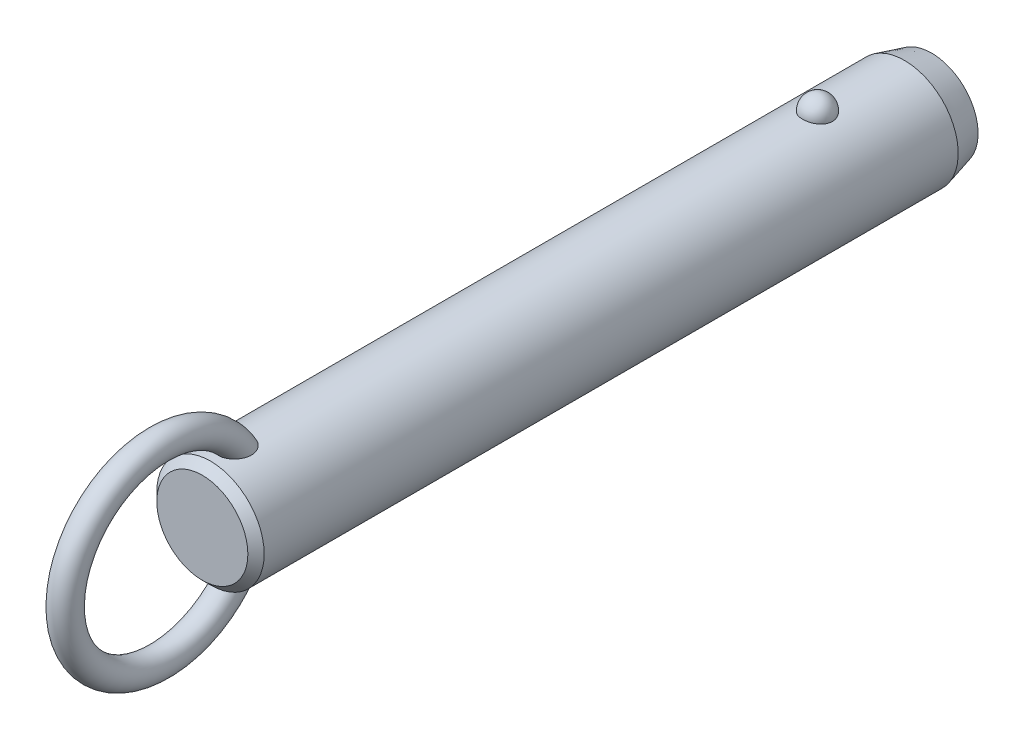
ISO-10303-21;
HEADER;
FILE_DESCRIPTION(('STEP AP214'),'2;1');
FILE_NAME('part.step','',(''),(''),'','','');
FILE_SCHEMA(('AUTOMOTIVE_DESIGN { 1 0 10303 214 1 1 1 1 }'));
ENDSEC;
DATA;
#1=APPLICATION_CONTEXT('core data for automotive mechanical design processes');
#2=APPLICATION_PROTOCOL_DEFINITION('international standard','automotive_design',2000,#1);
#3=PRODUCT_CONTEXT('',#1,'mechanical');
#4=PRODUCT('Part','Part','',(#3));
#5=PRODUCT_RELATED_PRODUCT_CATEGORY('part','',(#4));
#6=PRODUCT_DEFINITION_FORMATION('','',#4);
#7=PRODUCT_DEFINITION_CONTEXT('part definition',#1,'design');
#8=PRODUCT_DEFINITION('design','',#6,#7);
#9=PRODUCT_DEFINITION_SHAPE('','',#8);
#10=(LENGTH_UNIT() NAMED_UNIT(*) SI_UNIT(.MILLI.,.METRE.));
#11=(NAMED_UNIT(*) PLANE_ANGLE_UNIT() SI_UNIT($,.RADIAN.));
#12=(NAMED_UNIT(*) SI_UNIT($,.STERADIAN.) SOLID_ANGLE_UNIT());
#13=UNCERTAINTY_MEASURE_WITH_UNIT(LENGTH_MEASURE(1.E-05),#10,'distance_accuracy_value','');
#14=(GEOMETRIC_REPRESENTATION_CONTEXT(3) GLOBAL_UNCERTAINTY_ASSIGNED_CONTEXT((#13)) GLOBAL_UNIT_ASSIGNED_CONTEXT((#10,
#11,#12)) REPRESENTATION_CONTEXT('',''));
#15=CARTESIAN_POINT('',(0.,0.,0.));
#16=DIRECTION('',(0.,0.,1.));
#17=DIRECTION('',(1.,0.,0.));
#18=AXIS2_PLACEMENT_3D('',#15,#16,#17);
#19=CARTESIAN_POINT('',(0.,0.,78.8));
#20=DIRECTION('',(0.,0.,-1.));
#21=DIRECTION('',(-1.,0.,0.));
#22=AXIS2_PLACEMENT_3D('',#19,#20,#21);
#23=CYLINDRICAL_SURFACE('',#22,7.9);
#24=CARTESIAN_POINT('',(2.1785689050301,7.59367088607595,-2.19999999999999));
#25=CARTESIAN_POINT('',(2.17856679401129,7.59367269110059,-2.07701843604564));
#26=CARTESIAN_POINT('',(2.16853481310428,7.59657145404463,-1.95401006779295));
#27=CARTESIAN_POINT('',(2.12864689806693,7.607843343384,-1.71147811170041));
#28=CARTESIAN_POINT('',(2.09878338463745,7.61621856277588,-1.59195587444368));
#29=CARTESIAN_POINT('',(2.0199931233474,7.63749180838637,-1.3598563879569));
#30=CARTESIAN_POINT('',(1.97107475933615,7.6503878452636,-1.24727610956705));
#31=CARTESIAN_POINT('',(1.85539377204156,7.67926115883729,-1.03213234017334));
#32=CARTESIAN_POINT('',(1.78863158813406,7.69523835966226,-0.929568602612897));
#33=CARTESIAN_POINT('',(1.63856494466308,7.7285848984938,-0.736786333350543));
#34=CARTESIAN_POINT('',(1.55518140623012,7.7459606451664,-0.646630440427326));
#35=CARTESIAN_POINT('',(1.37422937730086,7.78009978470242,-0.481747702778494));
#36=CARTESIAN_POINT('',(1.27666086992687,7.79686317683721,-0.407020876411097));
#37=CARTESIAN_POINT('',(1.07024728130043,7.82786153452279,-0.275278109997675));
#38=CARTESIAN_POINT('',(0.961434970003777,7.84210353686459,-0.218212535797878));
#39=CARTESIAN_POINT('',(0.735351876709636,7.86652194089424,-0.123146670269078));
#40=CARTESIAN_POINT('',(0.618082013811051,7.87669878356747,-0.085144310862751));
#41=CARTESIAN_POINT('',(0.380637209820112,7.89170521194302,-0.0298158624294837));
#42=CARTESIAN_POINT('',(0.260550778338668,7.89662650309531,-0.0121347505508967));
#43=CARTESIAN_POINT('',(0.0190117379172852,7.90090003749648,0.00324379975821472));
#44=CARTESIAN_POINT('',(-0.102440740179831,7.90025280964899,0.00094313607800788));
#45=CARTESIAN_POINT('',(-0.341452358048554,7.89351056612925,-0.0233955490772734));
#46=CARTESIAN_POINT('',(-0.459042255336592,7.88749257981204,-0.0451545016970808));
#47=CARTESIAN_POINT('',(-0.688796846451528,7.87075812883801,-0.107408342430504));
#48=CARTESIAN_POINT('',(-0.800961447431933,7.86004158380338,-0.147903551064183));
#49=CARTESIAN_POINT('',(-1.01743634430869,7.83497131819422,-0.246799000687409));
#50=CARTESIAN_POINT('',(-1.12169791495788,7.82059709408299,-0.305300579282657));
#51=CARTESIAN_POINT('',(-1.31891765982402,7.78976470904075,-0.438549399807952));
#52=CARTESIAN_POINT('',(-1.41187469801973,7.77330633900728,-0.513298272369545));
#53=CARTESIAN_POINT('',(-1.58577142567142,7.73972434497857,-0.678622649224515));
#54=CARTESIAN_POINT('',(-1.66645140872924,7.72259402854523,-0.769470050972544));
#55=CARTESIAN_POINT('',(-1.81161503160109,7.68983776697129,-0.963538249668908));
#56=CARTESIAN_POINT('',(-1.87609753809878,7.6742119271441,-1.06675991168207));
#57=CARTESIAN_POINT('',(-1.98790138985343,7.6460202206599,-1.28401170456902));
#58=CARTESIAN_POINT('',(-2.03501994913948,7.63349104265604,-1.39815107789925));
#59=CARTESIAN_POINT('',(-2.10986724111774,7.6131449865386,-1.63301784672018));
#60=CARTESIAN_POINT('',(-2.1375965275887,7.60532797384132,-1.75374505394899));
#61=CARTESIAN_POINT('',(-2.17289256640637,7.5953195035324,-1.99782562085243));
#62=CARTESIAN_POINT('',(-2.18054294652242,7.59310471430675,-2.12116592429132));
#63=CARTESIAN_POINT('',(-2.17572919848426,7.59448538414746,-2.36741799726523));
#64=CARTESIAN_POINT('',(-2.1632656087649,7.59808068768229,-2.49032977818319));
#65=CARTESIAN_POINT('',(-2.11865035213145,7.61064035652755,-2.73161015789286));
#66=CARTESIAN_POINT('',(-2.08659579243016,7.61957823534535,-2.84999812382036));
#67=CARTESIAN_POINT('',(-2.00367799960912,7.64179982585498,-3.07955956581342));
#68=CARTESIAN_POINT('',(-1.9528140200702,7.65508371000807,-3.19073275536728));
#69=CARTESIAN_POINT('',(-1.83321113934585,7.68460381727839,-3.40337899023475));
#70=CARTESIAN_POINT('',(-1.76437735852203,7.70085556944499,-3.50479651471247));
#71=CARTESIAN_POINT('',(-1.61069526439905,7.73445734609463,-3.69446912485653));
#72=CARTESIAN_POINT('',(-1.52584634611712,7.75180741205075,-3.78272371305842));
#73=CARTESIAN_POINT('',(-1.34198059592,7.78574608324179,-3.94393987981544));
#74=CARTESIAN_POINT('',(-1.24291308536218,7.80233167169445,-4.01684434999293));
#75=CARTESIAN_POINT('',(-1.03352039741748,7.83281625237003,-4.14489386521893));
#76=CARTESIAN_POINT('',(-0.92319600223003,7.84671543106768,-4.20004014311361));
#77=CARTESIAN_POINT('',(-0.695822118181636,7.87011575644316,-4.29042017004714));
#78=CARTESIAN_POINT('',(-0.578872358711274,7.87966903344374,-4.32589112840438));
#79=CARTESIAN_POINT('',(-0.340410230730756,7.8935652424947,-4.37692226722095));
#80=CARTESIAN_POINT('',(-0.218898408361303,7.89790879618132,-4.39248482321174));
#81=CARTESIAN_POINT('',(0.0228107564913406,7.90087453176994,-4.40314405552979));
#82=CARTESIAN_POINT('',(0.142990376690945,7.89960185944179,-4.39861683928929));
#83=CARTESIAN_POINT('',(0.380829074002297,7.89171262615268,-4.37008293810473));
#84=CARTESIAN_POINT('',(0.498488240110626,7.8850962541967,-4.34607694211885));
#85=CARTESIAN_POINT('',(0.727535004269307,7.86726442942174,-4.27939317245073));
#86=CARTESIAN_POINT('',(0.838944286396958,7.85606616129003,-4.236785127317));
#87=CARTESIAN_POINT('',(1.05295421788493,7.83025654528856,-4.13408348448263));
#88=CARTESIAN_POINT('',(1.15555431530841,7.81564498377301,-4.07398879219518));
#89=CARTESIAN_POINT('',(1.35076763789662,7.7843022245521,-3.93687432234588));
#90=CARTESIAN_POINT('',(1.4432046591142,7.76754209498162,-3.85961036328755));
#91=CARTESIAN_POINT('',(1.6139111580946,7.73387857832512,-3.69076949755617));
#92=CARTESIAN_POINT('',(1.6921781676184,7.71697516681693,-3.59919010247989));
#93=CARTESIAN_POINT('',(1.83380875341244,7.6845643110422,-3.40247278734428));
#94=CARTESIAN_POINT('',(1.89689280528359,7.66908588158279,-3.29712873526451));
#95=CARTESIAN_POINT('',(2.0047823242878,7.64159441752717,-3.07707931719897));
#96=CARTESIAN_POINT('',(2.0495945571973,7.62958010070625,-2.96237743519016));
#97=CARTESIAN_POINT('',(2.11580183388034,7.61146617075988,-2.74040519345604));
#98=CARTESIAN_POINT('',(2.13929812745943,7.60484503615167,-2.63379846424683));
#99=CARTESIAN_POINT('',(2.17068242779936,7.59594664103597,-2.41813481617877));
#100=CARTESIAN_POINT('',(2.17857077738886,7.59366928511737,-2.30907795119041));
#101=CARTESIAN_POINT('',(2.1785689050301,7.59367088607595,-2.19999999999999));
#102=B_SPLINE_CURVE_WITH_KNOTS('',3,(#24,#25,#26,#27,#28,#29,#30,#31,#32,#33,#34,#35,#36,#37,
#38,#39,#40,#41,#42,#43,#44,#45,#46,#47,#48,#49,#50,#51,#52,#53,#54,#55,#56,#57,#58,#59,#60,#61,
#62,#63,#64,#65,#66,#67,#68,#69,#70,#71,#72,#73,#74,#75,#76,#77,#78,#79,#80,#81,#82,#83,#84,#85,
#86,#87,#88,#89,#90,#91,#92,#93,#94,#95,#96,#97,#98,#99,#100,#101),.UNSPECIFIED.,.T.,.F.,(4,2,2,
2,2,2,2,2,2,2,2,2,2,2,2,2,2,2,2,2,2,2,2,2,2,2,2,2,2,2,2,2,2,2,2,2,2,2,4),(0.,0.368552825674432,
0.737246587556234,1.10577831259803,1.4743009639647,1.8446206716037,2.21494081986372,
2.5842105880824,2.95344028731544,3.31611630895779,3.67875788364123,4.03628044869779,
4.39380913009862,4.75338791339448,5.11300280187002,5.47939989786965,5.8458226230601,
6.21639834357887,6.58696347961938,6.95598276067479,7.32499216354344,7.69218715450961,
8.0593967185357,8.42858578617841,8.79778880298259,9.16834203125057,9.5388695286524,
9.90482699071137,10.2707407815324,10.6298333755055,10.9889132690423,11.3466585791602,
11.7044262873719,12.0676511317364,12.4309391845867,12.8004764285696,13.1698767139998,
13.4967701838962,13.8236564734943),.UNSPECIFIED.);
#103=CARTESIAN_POINT('',(2.1785689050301,7.59367088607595,-2.19999999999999));
#104=VERTEX_POINT('',#103);
#105=EDGE_CURVE('E41',#104,#104,#102,.T.);
#106=ORIENTED_EDGE('',*,*,#105,.T.);
#107=EDGE_LOOP('',(#106));
#108=FACE_BOUND('',#107,.T.);
#109=CARTESIAN_POINT('',(0.,0.,87.12));
#110=DIRECTION('',(0.,0.,1.));
#111=DIRECTION('',(1.,0.,0.));
#112=AXIS2_PLACEMENT_3D('',#109,#110,#111);
#113=CIRCLE('',#112,7.9);
#114=CARTESIAN_POINT('',(7.9,0.,87.12));
#115=VERTEX_POINT('',#114);
#116=EDGE_CURVE('E10',#115,#115,#113,.F.);
#117=ORIENTED_EDGE('',*,*,#116,.T.);
#118=EDGE_LOOP('',(#117));
#119=FACE_BOUND('',#118,.T.);
#120=CARTESIAN_POINT('',(-0.630969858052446,-7.87476203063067,81.0124322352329));
#121=CARTESIAN_POINT('',(-0.734180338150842,-7.8664899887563,81.047285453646));
#122=CARTESIAN_POINT('',(-0.834476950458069,-7.85639291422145,81.0908160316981));
#123=CARTESIAN_POINT('',(-1.0262035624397,-7.83366343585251,81.194094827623));
#124=CARTESIAN_POINT('',(-1.1176141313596,-7.82102565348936,81.2538775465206));
#125=CARTESIAN_POINT('',(-1.28877277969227,-7.79464922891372,81.3878390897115));
#126=CARTESIAN_POINT('',(-1.36854014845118,-7.78091246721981,81.461993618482));
#127=CARTESIAN_POINT('',(-1.5146152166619,-7.75380398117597,81.6224941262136));
#128=CARTESIAN_POINT('',(-1.58092966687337,-7.74043207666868,81.7088339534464));
#129=CARTESIAN_POINT('',(-1.70019064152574,-7.71512522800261,81.8929784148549));
#130=CARTESIAN_POINT('',(-1.75284037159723,-7.70322473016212,81.9909792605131));
#131=CARTESIAN_POINT('',(-1.84263464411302,-7.68224112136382,82.1941029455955));
#132=CARTESIAN_POINT('',(-1.87977299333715,-7.6731591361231,82.2992286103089));
#133=CARTESIAN_POINT('',(-1.94152728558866,-7.65777930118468,82.5232849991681));
#134=CARTESIAN_POINT('',(-1.96475471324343,-7.65179654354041,82.6426167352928));
#135=CARTESIAN_POINT('',(-1.99449499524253,-7.64409642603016,82.8834298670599));
#136=CARTESIAN_POINT('',(-2.0010005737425,-7.64238092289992,83.0049121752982));
#137=CARTESIAN_POINT('',(-1.99856014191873,-7.64302120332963,83.2683409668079));
#138=CARTESIAN_POINT('',(-1.98680021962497,-7.64611845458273,83.4102565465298));
#139=CARTESIAN_POINT('',(-1.94457772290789,-7.65696186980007,83.6911188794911));
#140=CARTESIAN_POINT('',(-1.91409393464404,-7.66471330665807,83.8300620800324));
#141=CARTESIAN_POINT('',(-1.82768670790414,-7.68582947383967,84.1319397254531));
#142=CARTESIAN_POINT('',(-1.76772963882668,-7.70003779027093,84.293686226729));
#143=CARTESIAN_POINT('',(-1.65998501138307,-7.72371550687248,84.5276956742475));
#144=CARTESIAN_POINT('',(-1.621079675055,-7.73200670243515,84.6042974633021));
#145=CARTESIAN_POINT('',(-1.53727726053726,-7.7491037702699,84.7540798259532));
#146=CARTESIAN_POINT('',(-1.49238215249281,-7.75790947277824,84.8272615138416));
#147=CARTESIAN_POINT('',(-1.3739705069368,-7.77993338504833,85.0028838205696));
#148=CARTESIAN_POINT('',(-1.29690364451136,-7.79328473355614,85.1029557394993));
#149=CARTESIAN_POINT('',(-1.1288548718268,-7.81939266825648,85.2907147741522));
#150=CARTESIAN_POINT('',(-1.03789926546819,-7.83215032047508,85.3784247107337));
#151=CARTESIAN_POINT('',(-0.869532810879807,-7.85231710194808,85.5134148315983));
#152=CARTESIAN_POINT('',(-0.795716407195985,-7.86021093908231,85.565076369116));
#153=CARTESIAN_POINT('',(-0.64081313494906,-7.87434920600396,85.6563815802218));
#154=CARTESIAN_POINT('',(-0.559737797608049,-7.88059619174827,85.6960438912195));
#155=CARTESIAN_POINT('',(-0.406456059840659,-7.88984116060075,85.7543008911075));
#156=CARTESIAN_POINT('',(-0.335227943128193,-7.89321892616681,85.7753848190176));
#157=CARTESIAN_POINT('',(-0.190193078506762,-7.89804235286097,85.8054141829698));
#158=CARTESIAN_POINT('',(-0.116388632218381,-7.89948969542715,85.8143701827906));
#159=CARTESIAN_POINT('',(0.0318414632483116,-7.90028409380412,85.8192915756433));
#160=CARTESIAN_POINT('',(0.10626813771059,-7.89962640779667,85.8152276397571));
#161=CARTESIAN_POINT('',(0.253290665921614,-7.8962818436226,85.7944615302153));
#162=CARTESIAN_POINT('',(0.32588518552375,-7.8935935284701,85.7777504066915));
#163=CARTESIAN_POINT('',(0.481441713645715,-7.88577340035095,85.7287380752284));
#164=CARTESIAN_POINT('',(0.563611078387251,-7.88026321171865,85.694005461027));
#165=CARTESIAN_POINT('',(0.721129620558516,-7.86741729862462,85.6117965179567));
#166=CARTESIAN_POINT('',(0.796466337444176,-7.86007832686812,85.5642975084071));
#167=CARTESIAN_POINT('',(0.971456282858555,-7.84073285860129,85.436513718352));
#168=CARTESIAN_POINT('',(1.06719686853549,-7.82809461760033,85.3510047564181));
#169=CARTESIAN_POINT('',(1.24418921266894,-7.80192439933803,85.166232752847));
#170=CARTESIAN_POINT('',(1.32540832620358,-7.78839049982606,85.0669395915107));
#171=CARTESIAN_POINT('',(1.45199971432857,-7.76559693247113,84.8895760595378));
#172=CARTESIAN_POINT('',(1.5008564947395,-7.75626094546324,84.8139542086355));
#173=CARTESIAN_POINT('',(1.59197749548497,-7.7380727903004,84.6587428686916));
#174=CARTESIAN_POINT('',(1.63423919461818,-7.72922080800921,84.5791518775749));
#175=CARTESIAN_POINT('',(1.71222612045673,-7.71231959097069,84.4166640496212));
#176=CARTESIAN_POINT('',(1.7479451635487,-7.70427111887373,84.3337641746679));
#177=CARTESIAN_POINT('',(1.81270113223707,-7.68929240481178,84.1652967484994));
#178=CARTESIAN_POINT('',(1.84173789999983,-7.68236218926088,84.0797291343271));
#179=CARTESIAN_POINT('',(1.89322698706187,-7.66983757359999,83.9052870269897));
#180=CARTESIAN_POINT('',(1.91558744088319,-7.66426199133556,83.8163838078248));
#181=CARTESIAN_POINT('',(1.95281367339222,-7.65485915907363,83.6369696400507));
#182=CARTESIAN_POINT('',(1.96767946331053,-7.65103190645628,83.5464586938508));
#183=CARTESIAN_POINT('',(2.00021456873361,-7.64262981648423,83.2737320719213));
#184=CARTESIAN_POINT('',(2.00600691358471,-7.6410871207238,83.0897099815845));
#185=CARTESIAN_POINT('',(1.98445334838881,-7.64669564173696,82.7765019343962));
#186=CARTESIAN_POINT('',(1.96607186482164,-7.65149688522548,82.6466189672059));
#187=CARTESIAN_POINT('',(1.90884967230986,-7.6659762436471,82.3916321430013));
#188=CARTESIAN_POINT('',(1.8700210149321,-7.67565148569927,82.266525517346));
#189=CARTESIAN_POINT('',(1.77063986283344,-7.69918471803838,82.0245401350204));
#190=CARTESIAN_POINT('',(1.70993724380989,-7.71307150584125,81.9077250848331));
#191=CARTESIAN_POINT('',(1.56733070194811,-7.74330306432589,81.6881444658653));
#192=CARTESIAN_POINT('',(1.4854369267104,-7.75964665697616,81.5853722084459));
#193=CARTESIAN_POINT('',(1.31346177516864,-7.79047523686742,81.4093800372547));
#194=CARTESIAN_POINT('',(1.22547278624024,-7.80495298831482,81.3341066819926));
#195=CARTESIAN_POINT('',(1.03724352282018,-7.83218597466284,81.2004864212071));
#196=CARTESIAN_POINT('',(0.937008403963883,-7.84494192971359,81.1421324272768));
#197=CARTESIAN_POINT('',(0.733599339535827,-7.86649045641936,81.0470270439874));
#198=CARTESIAN_POINT('',(0.630941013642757,-7.87547134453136,81.0092109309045));
#199=CARTESIAN_POINT('',(0.420465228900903,-7.88950708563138,80.9511160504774));
#200=CARTESIAN_POINT('',(0.312645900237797,-7.89456050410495,80.9308436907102));
#201=CARTESIAN_POINT('',(0.0960869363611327,-7.9001518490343,80.9084559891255));
#202=CARTESIAN_POINT('',(-0.0126341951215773,-7.90073226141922,80.9061698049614));
#203=CARTESIAN_POINT('',(-0.228766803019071,-7.89742350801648,80.9193678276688));
#204=CARTESIAN_POINT('',(-0.336180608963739,-7.89354403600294,80.9348134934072));
#205=CARTESIAN_POINT('',(-0.473410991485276,-7.88586871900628,80.9662177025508));
#206=CARTESIAN_POINT('',(-0.50525779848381,-7.88388984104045,80.9743541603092));
#207=CARTESIAN_POINT('',(-0.5684812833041,-7.87958326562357,80.9922083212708));
#208=CARTESIAN_POINT('',(-0.599857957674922,-7.87725556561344,81.0019260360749));
#209=CARTESIAN_POINT('',(-0.630969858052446,-7.87476203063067,81.0124322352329));
#210=B_SPLINE_CURVE_WITH_KNOTS('',3,(#120,#121,#122,#123,#124,#125,#126,#127,#128,#129,#130,
#131,#132,#133,#134,#135,#136,#137,#138,#139,#140,#141,#142,#143,#144,#145,#146,#147,#148,#149,
#150,#151,#152,#153,#154,#155,#156,#157,#158,#159,#160,#161,#162,#163,#164,#165,#166,#167,#168,
#169,#170,#171,#172,#173,#174,#175,#176,#177,#178,#179,#180,#181,#182,#183,#184,#185,#186,#187,
#188,#189,#190,#191,#192,#193,#194,#195,#196,#197,#198,#199,#200,#201,#202,#203,#204,#205,#206,
#207,#208,#209),.UNSPECIFIED.,.T.,.F.,(4,2,2,2,2,2,2,2,2,2,2,2,2,2,2,2,2,2,2,2,2,2,2,2,2,2,2,2,
2,2,2,2,2,2,2,2,2,2,2,2,2,2,2,2,4),(0.,0.327622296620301,0.655945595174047,0.983718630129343,
1.3113267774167,1.64554655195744,1.9798996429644,2.34365728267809,2.70757317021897,
3.13333684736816,3.55958380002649,4.07655306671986,4.3352789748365,4.59391999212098,
4.97382437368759,5.35301797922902,5.62348245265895,5.89352465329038,6.11565959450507,
6.3376009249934,6.56004255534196,6.78264174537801,7.04930844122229,7.31645206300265,
7.70130871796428,8.08701995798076,8.35824509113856,8.62957365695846,8.90115735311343,
9.17274746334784,9.44791855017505,9.72308922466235,10.2715298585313,10.6638393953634,
11.0559179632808,11.4507403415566,11.845374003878,12.1936425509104,12.5417649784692,
12.8695063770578,13.1973674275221,13.5221104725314,13.8461490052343,13.9449071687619,
14.0436660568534),.UNSPECIFIED.);
#211=CARTESIAN_POINT('',(-0.630969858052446,-7.87476203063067,81.0124322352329));
#212=VERTEX_POINT('',#211);
#213=EDGE_CURVE('E60',#212,#212,#210,.T.);
#214=ORIENTED_EDGE('',*,*,#213,.T.);
#215=EDGE_LOOP('',(#214));
#216=FACE_BOUND('',#215,.T.);
#217=CARTESIAN_POINT('',(-0.630969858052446,7.87476203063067,81.0124322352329));
#218=CARTESIAN_POINT('',(-0.52891882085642,7.88293636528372,80.9779798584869));
#219=CARTESIAN_POINT('',(-0.423745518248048,7.8893481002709,80.951915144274));
#220=CARTESIAN_POINT('',(-0.210236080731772,7.8979273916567,80.9172825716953));
#221=CARTESIAN_POINT('',(-0.10189380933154,7.90008607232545,80.9087513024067));
#222=CARTESIAN_POINT('',(0.114660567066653,7.89990877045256,80.9094570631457));
#223=CARTESIAN_POINT('',(0.222872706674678,7.89757640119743,80.9186798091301));
#224=CARTESIAN_POINT('',(0.436107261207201,7.88867538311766,80.9546525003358));
#225=CARTESIAN_POINT('',(0.541131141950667,7.8821087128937,80.9813942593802));
#226=CARTESIAN_POINT('',(0.745085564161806,7.86545130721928,81.0517561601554));
#227=CARTESIAN_POINT('',(0.844015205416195,7.85536005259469,81.0953787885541));
#228=CARTESIAN_POINT('',(1.03299167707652,7.83275153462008,81.1983796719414));
#229=CARTESIAN_POINT('',(1.12303841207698,7.8202342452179,81.2577580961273));
#230=CARTESIAN_POINT('',(1.29214734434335,7.79408219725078,81.3908647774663));
#231=CARTESIAN_POINT('',(1.37116907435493,7.78044359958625,81.4646436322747));
#232=CARTESIAN_POINT('',(1.51597677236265,7.75353170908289,81.6242353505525));
#233=CARTESIAN_POINT('',(1.58176261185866,7.74025841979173,81.7100483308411));
#234=CARTESIAN_POINT('',(1.70057386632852,7.71504069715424,81.893644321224));
#235=CARTESIAN_POINT('',(1.75320073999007,7.7031425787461,81.9916906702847));
#236=CARTESIAN_POINT('',(1.8429376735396,7.68216822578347,82.1948931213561));
#237=CARTESIAN_POINT('',(1.88004278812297,7.67309289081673,82.3000514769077));
#238=CARTESIAN_POINT('',(1.9417232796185,7.6577294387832,82.5241671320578));
#239=CARTESIAN_POINT('',(1.96491037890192,7.65175648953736,82.6435248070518));
#240=CARTESIAN_POINT('',(1.9945689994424,7.64407702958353,82.8843848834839));
#241=CARTESIAN_POINT('',(2.00103304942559,7.64237242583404,83.0058882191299));
#242=CARTESIAN_POINT('',(1.9985016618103,7.64303650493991,83.2693688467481));
#243=CARTESIAN_POINT('',(1.98669038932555,7.64614714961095,83.4113141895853));
#244=CARTESIAN_POINT('',(1.94436120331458,7.6570170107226,83.6922287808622));
#245=CARTESIAN_POINT('',(1.91382203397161,7.66478150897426,83.8311944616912));
#246=CARTESIAN_POINT('',(1.82728754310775,7.68592483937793,84.1331110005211));
#247=CARTESIAN_POINT('',(1.76725778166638,7.70014685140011,84.294872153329));
#248=CARTESIAN_POINT('',(1.65939700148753,7.72384204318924,84.5288914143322));
#249=CARTESIAN_POINT('',(1.62045187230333,7.73213852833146,84.6054942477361));
#250=CARTESIAN_POINT('',(1.5365668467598,7.74924489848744,84.7552737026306));
#251=CARTESIAN_POINT('',(1.49162892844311,7.75805461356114,84.8284514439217));
#252=CARTESIAN_POINT('',(1.37317698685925,7.78007342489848,85.0039520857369));
#253=CARTESIAN_POINT('',(1.29612360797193,7.79341423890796,85.1039112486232));
#254=CARTESIAN_POINT('',(1.12812043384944,7.81949839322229,85.2914508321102));
#255=CARTESIAN_POINT('',(1.03719688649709,7.83224280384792,85.3790540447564));
#256=CARTESIAN_POINT('',(0.868871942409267,7.85239026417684,85.5138971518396));
#257=CARTESIAN_POINT('',(0.795056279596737,7.86027769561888,85.5655113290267));
#258=CARTESIAN_POINT('',(0.640160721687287,7.87440222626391,85.6567201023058));
#259=CARTESIAN_POINT('',(0.559092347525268,7.88064188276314,85.6963333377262));
#260=CARTESIAN_POINT('',(0.405820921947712,7.8898738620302,85.7545056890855));
#261=CARTESIAN_POINT('',(0.33459413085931,7.89324577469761,85.7755523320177));
#262=CARTESIAN_POINT('',(0.189568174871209,7.89805733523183,85.8055070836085));
#263=CARTESIAN_POINT('',(0.115771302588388,7.89949866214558,85.8144257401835));
#264=CARTESIAN_POINT('',(-0.0324359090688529,7.90028156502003,85.8192758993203));
#265=CARTESIAN_POINT('',(-0.106847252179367,7.89961843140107,85.8151782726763));
#266=CARTESIAN_POINT('',(-0.253834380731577,7.8962642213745,85.7943519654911));
#267=CARTESIAN_POINT('',(-0.326408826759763,7.89357170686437,85.7776143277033));
#268=CARTESIAN_POINT('',(-0.481962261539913,7.88574179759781,85.7285391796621));
#269=CARTESIAN_POINT('',(-0.564145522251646,7.88022507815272,85.6937638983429));
#270=CARTESIAN_POINT('',(-0.721685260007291,7.86736646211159,85.6114686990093));
#271=CARTESIAN_POINT('',(-0.797029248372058,7.8600213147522,85.5639260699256));
#272=CARTESIAN_POINT('',(-0.97204426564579,7.84066026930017,85.4360267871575));
#273=CARTESIAN_POINT('',(-1.06779803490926,7.82801274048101,85.3504436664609));
#274=CARTESIAN_POINT('',(-1.24480531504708,7.80182621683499,85.1655223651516));
#275=CARTESIAN_POINT('',(-1.32602618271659,7.78828530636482,85.0661540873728));
#276=CARTESIAN_POINT('',(-1.45259834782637,7.76548487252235,84.8886806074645));
#277=CARTESIAN_POINT('',(-1.50143856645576,7.75614818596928,84.8130252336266));
#278=CARTESIAN_POINT('',(-1.59252410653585,7.73796020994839,84.6577484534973));
#279=CARTESIAN_POINT('',(-1.63476690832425,7.72910910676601,84.5781255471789));
#280=CARTESIAN_POINT('',(-1.71271318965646,7.71221133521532,84.4155750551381));
#281=CARTESIAN_POINT('',(-1.74841047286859,7.70416543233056,84.3326444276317));
#282=CARTESIAN_POINT('',(-1.81311929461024,7.6891937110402,84.1641168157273));
#283=CARTESIAN_POINT('',(-1.84213067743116,7.6822679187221,84.0785197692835));
#284=CARTESIAN_POINT('',(-1.89356259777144,7.66975461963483,83.9040254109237));
#285=CARTESIAN_POINT('',(-1.91589165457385,7.66418586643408,83.8150995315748));
#286=CARTESIAN_POINT('',(-1.95305070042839,7.65479859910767,83.6356424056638));
#287=CARTESIAN_POINT('',(-1.96788069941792,7.65098008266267,83.5451111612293));
#288=CARTESIAN_POINT('',(-2.00030078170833,7.64260704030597,83.2723270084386));
#289=CARTESIAN_POINT('',(-2.00600576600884,7.64108760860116,83.0882718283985));
#290=CARTESIAN_POINT('',(-1.98428483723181,7.64673945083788,82.7750800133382));
#291=CARTESIAN_POINT('',(-1.96583698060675,7.6515575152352,82.6452400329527));
#292=CARTESIAN_POINT('',(-1.90848948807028,7.66606613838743,82.3903619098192));
#293=CARTESIAN_POINT('',(-1.86960376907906,7.67575338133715,82.265320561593));
#294=CARTESIAN_POINT('',(-1.7701342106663,7.6993013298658,82.0235009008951));
#295=CARTESIAN_POINT('',(-1.70940488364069,7.71318991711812,81.9067844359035));
#296=CARTESIAN_POINT('',(-1.56672953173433,7.74342495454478,81.6873404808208));
#297=CARTESIAN_POINT('',(-1.48478316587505,7.75977144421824,81.5846132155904));
#298=CARTESIAN_POINT('',(-1.31266325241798,7.79061163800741,81.4086431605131));
#299=CARTESIAN_POINT('',(-1.22456383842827,7.80509908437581,81.3333589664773));
#300=CARTESIAN_POINT('',(-1.03622400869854,7.83231881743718,81.1998659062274));
#301=CARTESIAN_POINT('',(-0.936015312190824,7.84505551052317,81.1416137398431));
#302=CARTESIAN_POINT('',(-0.798824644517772,7.85957802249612,81.0775408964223));
#303=CARTESIAN_POINT('',(-0.765787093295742,7.86286821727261,81.0632248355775));
#304=CARTESIAN_POINT('',(-0.698939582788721,7.86909211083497,81.036436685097));
#305=CARTESIAN_POINT('',(-0.665129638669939,7.8720258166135,81.0239645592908));
#306=CARTESIAN_POINT('',(-0.630969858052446,7.87476203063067,81.0124322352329));
#307=B_SPLINE_CURVE_WITH_KNOTS('',3,(#217,#218,#219,#220,#221,#222,#223,#224,#225,#226,#227,
#228,#229,#230,#231,#232,#233,#234,#235,#236,#237,#238,#239,#240,#241,#242,#243,#244,#245,#246,
#247,#248,#249,#250,#251,#252,#253,#254,#255,#256,#257,#258,#259,#260,#261,#262,#263,#264,#265,
#266,#267,#268,#269,#270,#271,#272,#273,#274,#275,#276,#277,#278,#279,#280,#281,#282,#283,#284,
#285,#286,#287,#288,#289,#290,#291,#292,#293,#294,#295,#296,#297,#298,#299,#300,#301,#302,#303,
#304,#305,#306),.UNSPECIFIED.,.T.,.F.,(4,2,2,2,2,2,2,2,2,2,2,2,2,2,2,2,2,2,2,2,2,2,2,2,2,2,2,2,
2,2,2,2,2,2,2,2,2,2,2,2,2,2,2,2,4),(0.,0.323920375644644,0.648516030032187,0.97285063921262,
1.29703380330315,1.62126473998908,1.94549915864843,2.27089401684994,2.5962920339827,
2.93059633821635,3.26500707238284,3.62881644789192,3.99278833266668,4.41865421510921,
4.84500434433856,5.36209210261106,5.62087589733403,5.87957448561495,6.25918598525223,
6.63808782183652,6.90846748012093,7.17842501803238,7.40052350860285,7.62242871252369,
7.84483086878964,8.06739077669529,8.33414615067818,8.60137921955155,8.98641454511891,
9.3723041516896,9.6435867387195,9.91497268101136,10.1866142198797,10.4582620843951,
10.7334745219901,11.0086865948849,11.5572126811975,11.9494246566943,12.3413699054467,
12.7359755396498,13.1305875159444,13.4791770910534,13.82687259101,13.9353013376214,
14.0437279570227),.UNSPECIFIED.);
#308=CARTESIAN_POINT('',(-0.630969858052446,7.87476203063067,81.0124322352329));
#309=VERTEX_POINT('',#308);
#310=EDGE_CURVE('E68',#309,#309,#307,.T.);
#311=ORIENTED_EDGE('',*,*,#310,.T.);
#312=EDGE_LOOP('',(#311));
#313=FACE_BOUND('',#312,.T.);
#314=CARTESIAN_POINT('',(0.,0.,-14.9999999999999));
#315=DIRECTION('',(0.,0.,-1.));
#316=DIRECTION('',(-1.,0.,0.));
#317=AXIS2_PLACEMENT_3D('',#314,#315,#316);
#318=CIRCLE('',#317,7.9);
#319=CARTESIAN_POINT('',(-7.9,0.,-14.9999999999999));
#320=VERTEX_POINT('',#319);
#321=EDGE_CURVE('E57',#320,#320,#318,.F.);
#322=ORIENTED_EDGE('',*,*,#321,.T.);
#323=EDGE_LOOP('',(#322));
#324=FACE_BOUND('',#323,.T.);
#325=ADVANCED_FACE('F37',(#108,#119,#216,#313,#324),#23,.T.);
#326=CARTESIAN_POINT('',(0.,0.,-19.));
#327=DIRECTION('',(0.,0.,-1.));
#328=DIRECTION('',(-1.,0.,0.));
#329=AXIS2_PLACEMENT_3D('',#326,#327,#328);
#330=PLANE('',#329);
#331=CARTESIAN_POINT('',(0.,0.,-19.));
#332=DIRECTION('',(0.,0.,-1.));
#333=DIRECTION('',(-1.,0.,0.));
#334=AXIS2_PLACEMENT_3D('',#331,#332,#333);
#335=CIRCLE('',#334,6.82820323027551);
#336=CARTESIAN_POINT('',(-6.82820323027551,0.,-19.));
#337=VERTEX_POINT('',#336);
#338=EDGE_CURVE('E67',#337,#337,#335,.T.);
#339=ORIENTED_EDGE('',*,*,#338,.T.);
#340=EDGE_LOOP('',(#339));
#341=FACE_BOUND('',#340,.T.);
#342=ADVANCED_FACE('F86',(#341),#330,.T.);
#343=CARTESIAN_POINT('',(0.,0.,-19.));
#344=DIRECTION('',(0.,0.,1.));
#345=DIRECTION('',(1.,0.,0.));
#346=AXIS2_PLACEMENT_3D('',#343,#344,#345);
#347=CONICAL_SURFACE('',#346,6.82820323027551,0.261799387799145);
#348=ORIENTED_EDGE('',*,*,#321,.F.);
#349=EDGE_LOOP('',(#348));
#350=FACE_BOUND('',#349,.T.);
#351=ORIENTED_EDGE('',*,*,#338,.F.);
#352=EDGE_LOOP('',(#351));
#353=FACE_BOUND('',#352,.T.);
#354=ADVANCED_FACE('F84',(#350,#353),#347,.T.);
#355=CARTESIAN_POINT('',(0.,0.,88.32));
#356=DIRECTION('',(0.,0.,1.));
#357=DIRECTION('',(1.,0.,0.));
#358=AXIS2_PLACEMENT_3D('',#355,#356,#357);
#359=PLANE('',#358);
#360=CARTESIAN_POINT('',(0.,0.,88.32));
#361=DIRECTION('',(0.,0.,1.));
#362=DIRECTION('',(1.,0.,0.));
#363=AXIS2_PLACEMENT_3D('',#360,#361,#362);
#364=CIRCLE('',#363,6.70000000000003);
#365=CARTESIAN_POINT('',(6.70000000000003,0.,88.32));
#366=VERTEX_POINT('',#365);
#367=EDGE_CURVE('E50',#366,#366,#364,.T.);
#368=ORIENTED_EDGE('',*,*,#367,.T.);
#369=EDGE_LOOP('',(#368));
#370=FACE_BOUND('',#369,.T.);
#371=ADVANCED_FACE('F78',(#370),#359,.T.);
#372=CARTESIAN_POINT('',(0.,0.,94.65));
#373=DIRECTION('',(1.,0.,0.));
#374=DIRECTION('',(0.,0.,-1.));
#375=AXIS2_PLACEMENT_3D('',#372,#373,#374);
#376=TOROIDAL_SURFACE('',#375,13.85,2.);
#377=ORIENTED_EDGE('',*,*,#310,.F.);
#378=EDGE_LOOP('',(#377));
#379=FACE_BOUND('',#378,.T.);
#380=ORIENTED_EDGE('',*,*,#213,.F.);
#381=EDGE_LOOP('',(#380));
#382=FACE_BOUND('',#381,.T.);
#383=ADVANCED_FACE('F74',(#379,#382),#376,.T.);
#384=CARTESIAN_POINT('',(0.,0.,88.32));
#385=DIRECTION('',(0.,0.,-1.));
#386=DIRECTION('',(-1.,0.,0.));
#387=AXIS2_PLACEMENT_3D('',#384,#385,#386);
#388=CONICAL_SURFACE('',#387,6.70000000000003,0.785398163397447);
#389=ORIENTED_EDGE('',*,*,#116,.F.);
#390=EDGE_LOOP('',(#389));
#391=FACE_BOUND('',#390,.T.);
#392=ORIENTED_EDGE('',*,*,#367,.F.);
#393=EDGE_LOOP('',(#392));
#394=FACE_BOUND('',#393,.T.);
#395=ADVANCED_FACE('F39',(#391,#394),#388,.T.);
#396=CARTESIAN_POINT('',(0.,7.9,-2.19999999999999));
#397=DIRECTION('',(0.,1.,0.));
#398=DIRECTION('',(0.,0.,-1.));
#399=AXIS2_PLACEMENT_3D('',#396,#397,#398);
#400=SPHERICAL_SURFACE('',#399,2.2);
#401=ORIENTED_EDGE('',*,*,#105,.F.);
#402=EDGE_LOOP('',(#401));
#403=FACE_BOUND('',#402,.T.);
#404=ADVANCED_FACE('F80',(#403),#400,.T.);
#405=CLOSED_SHELL('',(#325,#342,#354,#371,#383,#395,#404));
#406=MANIFOLD_SOLID_BREP('B2',#405);
#407=ADVANCED_BREP_SHAPE_REPRESENTATION('',(#18,#406),#14);
#408=SHAPE_DEFINITION_REPRESENTATION(#9,#407);
ENDSEC;
END-ISO-10303-21;
